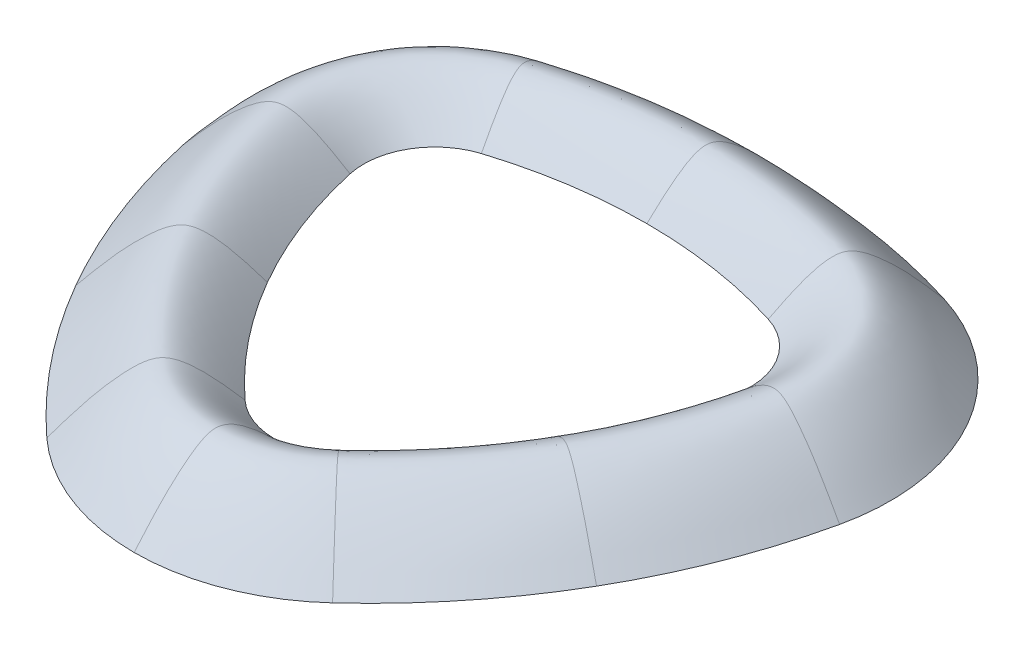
ISO-10303-21;
HEADER;
FILE_DESCRIPTION(('STEP AP214'),'2;1');
FILE_NAME('part.step','',(''),(''),'','','');
FILE_SCHEMA(('AUTOMOTIVE_DESIGN { 1 0 10303 214 1 1 1 1 }'));
ENDSEC;
DATA;
#1=APPLICATION_CONTEXT('core data for automotive mechanical design processes');
#2=APPLICATION_PROTOCOL_DEFINITION('international standard','automotive_design',2000,#1);
#3=PRODUCT_CONTEXT('',#1,'mechanical');
#4=PRODUCT('Part','Part','',(#3));
#5=PRODUCT_RELATED_PRODUCT_CATEGORY('part','',(#4));
#6=PRODUCT_DEFINITION_FORMATION('','',#4);
#7=PRODUCT_DEFINITION_CONTEXT('part definition',#1,'design');
#8=PRODUCT_DEFINITION('design','',#6,#7);
#9=PRODUCT_DEFINITION_SHAPE('','',#8);
#10=(LENGTH_UNIT() NAMED_UNIT(*) SI_UNIT(.MILLI.,.METRE.));
#11=(NAMED_UNIT(*) PLANE_ANGLE_UNIT() SI_UNIT($,.RADIAN.));
#12=(NAMED_UNIT(*) SI_UNIT($,.STERADIAN.) SOLID_ANGLE_UNIT());
#13=UNCERTAINTY_MEASURE_WITH_UNIT(LENGTH_MEASURE(1.E-05),#10,'distance_accuracy_value','');
#14=(GEOMETRIC_REPRESENTATION_CONTEXT(3) GLOBAL_UNCERTAINTY_ASSIGNED_CONTEXT((#13)) GLOBAL_UNIT_ASSIGNED_CONTEXT((#10,
#11,#12)) REPRESENTATION_CONTEXT('',''));
#15=CARTESIAN_POINT('',(0.,0.,0.));
#16=DIRECTION('',(0.,0.,1.));
#17=DIRECTION('',(1.,0.,0.));
#18=AXIS2_PLACEMENT_3D('',#15,#16,#17);
#19=DIRECTION('',(-0.675899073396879,0.00535319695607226,-0.73697475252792));
#20=VECTOR('',#19,1.);
#21=CARTESIAN_POINT('',(28.2532258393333,113.999999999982,33.5021687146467));
#22=LINE('',#21,#20);
#23=CARTESIAN_POINT('',(17.1026226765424,109.999999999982,21.340161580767));
#24=DIRECTION('',(0.,-1.,0.));
#25=AXIS1_PLACEMENT('',#23,#24);
#26=SURFACE_OF_REVOLUTION('',#22,#25);
#27=CARTESIAN_POINT('',(28.2532258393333,113.999999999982,33.5021687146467));
#28=VERTEX_POINT('',#27);
#29=CARTESIAN_POINT('',(23.923493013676,114.034291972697,28.781192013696));
#30=VERTEX_POINT('',#29);
#31=EDGE_CURVE('E197',#28,#30,#22,.T.);
#32=ORIENTED_EDGE('',*,*,#31,.F.);
#33=CARTESIAN_POINT('',(17.1026226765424,113.999999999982,21.340161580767));
#34=DIRECTION('',(0.,-1.,0.));
#35=DIRECTION('',(0.,0.,-1.));
#36=AXIS2_PLACEMENT_3D('',#33,#34,#35);
#37=CIRCLE('',#36,16.5000111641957);
#38=CARTESIAN_POINT('',(17.1000208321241,113.999999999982,37.8401725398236));
#39=VERTEX_POINT('',#38);
#40=EDGE_CURVE('E45',#28,#39,#37,.T.);
#41=ORIENTED_EDGE('',*,*,#40,.T.);
#42=CARTESIAN_POINT('',(17.1000208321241,113.999999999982,37.8401725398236));
#43=CARTESIAN_POINT('',(17.1000212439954,114.001428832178,37.573264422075));
#44=CARTESIAN_POINT('',(17.1000216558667,114.002857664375,37.3063563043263));
#45=CARTESIAN_POINT('',(17.1000224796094,114.005715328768,36.772540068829));
#46=CARTESIAN_POINT('',(17.1000228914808,114.007144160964,36.5056319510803));
#47=CARTESIAN_POINT('',(17.1000237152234,114.010001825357,35.971815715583));
#48=CARTESIAN_POINT('',(17.1000241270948,114.011430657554,35.7049075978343));
#49=CARTESIAN_POINT('',(17.1000249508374,114.014288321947,35.171091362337));
#50=CARTESIAN_POINT('',(17.1000253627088,114.015717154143,34.9041832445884));
#51=CARTESIAN_POINT('',(17.1000261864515,114.018574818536,34.3703670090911));
#52=CARTESIAN_POINT('',(17.1000265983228,114.020003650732,34.1034588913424));
#53=CARTESIAN_POINT('',(17.1000274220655,114.022861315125,33.5696426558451));
#54=CARTESIAN_POINT('',(17.1000278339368,114.024290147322,33.3027345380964));
#55=CARTESIAN_POINT('',(17.1000286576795,114.027147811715,32.7689183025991));
#56=CARTESIAN_POINT('',(17.1000290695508,114.028576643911,32.5020101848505));
#57=CARTESIAN_POINT('',(17.1000298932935,114.031434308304,31.9681939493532));
#58=CARTESIAN_POINT('',(17.1000303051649,114.0328631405,31.7012858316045));
#59=CARTESIAN_POINT('',(17.1000307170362,114.034291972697,31.4343777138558));
#60=B_SPLINE_CURVE_WITH_KNOTS('',3,(#42,#43,#44,#45,#46,#47,#48,#49,#50,#51,#52,#53,#54,#55,#56,
#57,#58,#59),.UNSPECIFIED.,.F.,.F.,(4,2,2,2,2,2,2,2,4),(0.,0.800735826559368,1.60147165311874,
2.4022074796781,3.20294330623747,4.00367913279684,4.80441495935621,5.60515078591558,
6.40588661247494),.UNSPECIFIED.);
#61=CARTESIAN_POINT('',(17.1000307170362,114.034291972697,31.4343777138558));
#62=VERTEX_POINT('',#61);
#63=EDGE_CURVE('E188',#39,#62,#60,.T.);
#64=ORIENTED_EDGE('',*,*,#63,.T.);
#65=CARTESIAN_POINT('',(17.1026226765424,114.034291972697,21.340161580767));
#66=DIRECTION('',(0.,-1.,0.));
#67=DIRECTION('',(0.,0.,-1.));
#68=AXIS2_PLACEMENT_3D('',#65,#66,#67);
#69=CIRCLE('',#68,10.0942164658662);
#70=EDGE_CURVE('E11',#30,#62,#69,.T.);
#71=ORIENTED_EDGE('',*,*,#70,.F.);
#72=EDGE_LOOP('',(#32,#41,#64,#71));
#73=FACE_BOUND('',#72,.T.);
#74=ADVANCED_FACE('F35',(#73),#26,.T.);
#75=CARTESIAN_POINT('',(23.923493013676,114.034291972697,28.781192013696));
#76=CARTESIAN_POINT('',(26.1064058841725,117.097954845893,31.1613575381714));
#77=CARTESIAN_POINT('',(28.0348659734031,119.363847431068,33.2640773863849));
#78=CARTESIAN_POINT('',(30.3911515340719,119.628897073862,35.8332819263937));
#79=CARTESIAN_POINT('',(33.8820799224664,116.139888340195,39.6396580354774));
#80=CARTESIAN_POINT('',(36.0071001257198,112.293182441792,41.9566995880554));
#81=CARTESIAN_POINT('',(37.3779940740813,109.999999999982,43.4514704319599));
#82=B_SPLINE_CURVE_WITH_KNOTS('',3,(#75,#76,#77,#78,#79,#80,#81),.UNSPECIFIED.,.F.,.F.,(4,1,1,1,
4),(0.,0.293862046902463,0.347704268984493,0.538422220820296,1.),.UNSPECIFIED.);
#83=CARTESIAN_POINT('',(17.1026226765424,109.999999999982,21.340161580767));
#84=DIRECTION('',(0.,-1.,0.));
#85=AXIS1_PLACEMENT('',#83,#84);
#86=SURFACE_OF_REVOLUTION('',#82,#85);
#87=CARTESIAN_POINT('',(37.3779940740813,109.999999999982,43.4514704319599));
#88=VERTEX_POINT('',#87);
#89=EDGE_CURVE('E479',#30,#88,#82,.T.);
#90=ORIENTED_EDGE('',*,*,#89,.F.);
#91=ORIENTED_EDGE('',*,*,#70,.T.);
#92=CARTESIAN_POINT('',(17.1000307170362,114.034291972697,31.4343777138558));
#93=CARTESIAN_POINT('',(17.1000302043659,114.349166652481,31.766607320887));
#94=CARTESIAN_POINT('',(17.1000296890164,114.662297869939,32.1005732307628));
#95=CARTESIAN_POINT('',(17.1000286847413,115.261245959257,32.7513812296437));
#96=CARTESIAN_POINT('',(17.1000281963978,115.547473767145,33.0678462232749));
#97=CARTESIAN_POINT('',(17.1000272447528,116.091875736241,33.6845479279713));
#98=CARTESIAN_POINT('',(17.1000267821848,116.350584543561,33.9843093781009));
#99=CARTESIAN_POINT('',(17.1000258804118,116.838901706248,34.5686922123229));
#100=CARTESIAN_POINT('',(17.100025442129,117.069221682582,34.8527159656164));
#101=CARTESIAN_POINT('',(17.1000245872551,117.499792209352,35.4067064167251));
#102=CARTESIAN_POINT('',(17.1000241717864,117.700966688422,35.675945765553));
#103=CARTESIAN_POINT('',(17.1000235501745,117.985441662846,36.0787736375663));
#104=CARTESIAN_POINT('',(17.1000233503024,118.074495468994,36.2082982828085));
#105=CARTESIAN_POINT('',(17.1000229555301,118.244796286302,36.4641255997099));
#106=CARTESIAN_POINT('',(17.1000227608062,118.326214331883,36.590313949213));
#107=CARTESIAN_POINT('',(17.1000223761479,118.481123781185,36.8395869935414));
#108=CARTESIAN_POINT('',(17.1000221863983,118.554807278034,36.9625518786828));
#109=CARTESIAN_POINT('',(17.100021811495,118.694120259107,37.2055033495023));
#110=CARTESIAN_POINT('',(17.1000216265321,118.759964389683,37.3253662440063));
#111=CARTESIAN_POINT('',(17.1000212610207,118.883469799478,37.5622313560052));
#112=CARTESIAN_POINT('',(17.1000210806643,118.941368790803,37.6791090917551));
#113=CARTESIAN_POINT('',(17.1000207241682,119.048861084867,37.9101319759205));
#114=CARTESIAN_POINT('',(17.1000205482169,119.098714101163,38.0241550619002));
#115=CARTESIAN_POINT('',(17.1000202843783,119.167938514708,38.1951323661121));
#116=CARTESIAN_POINT('',(17.100020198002,119.189741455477,38.251107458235));
#117=CARTESIAN_POINT('',(17.1000200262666,119.231257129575,38.3623984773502));
#118=CARTESIAN_POINT('',(17.1000199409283,119.251005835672,38.4177009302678));
#119=CARTESIAN_POINT('',(17.1000197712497,119.28839884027,38.5276590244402));
#120=CARTESIAN_POINT('',(17.1000196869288,119.306079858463,38.5823021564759));
#121=CARTESIAN_POINT('',(17.1000195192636,119.339324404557,38.6909554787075));
#122=CARTESIAN_POINT('',(17.100019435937,119.354925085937,38.7449542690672));
#123=CARTESIAN_POINT('',(17.1000192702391,119.383993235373,38.8523327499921));
#124=CARTESIAN_POINT('',(17.1000191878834,119.397497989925,38.905702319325));
#125=CARTESIAN_POINT('',(17.1000190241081,119.422369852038,39.0118348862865));
#126=CARTESIAN_POINT('',(17.1000189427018,119.433773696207,39.0645892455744));
#127=CARTESIAN_POINT('',(17.1000187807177,119.454404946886,39.1695610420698));
#128=CARTESIAN_POINT('',(17.1000187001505,119.463667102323,39.2217716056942));
#129=CARTESIAN_POINT('',(17.1000185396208,119.479920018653,39.3258008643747));
#130=CARTESIAN_POINT('',(17.1000184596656,119.486940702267,39.3776148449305));
#131=CARTESIAN_POINT('',(17.1000183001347,119.498632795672,39.4809968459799));
#132=CARTESIAN_POINT('',(17.100018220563,119.503326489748,39.5325623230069));
#133=CARTESIAN_POINT('',(17.1000180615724,119.510286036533,39.6355941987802));
#134=CARTESIAN_POINT('',(17.1000179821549,119.512564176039,39.6870597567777));
#135=CARTESIAN_POINT('',(17.1000178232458,119.514615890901,39.7900387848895));
#136=CARTESIAN_POINT('',(17.1000177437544,119.514389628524,39.8415522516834));
#137=CARTESIAN_POINT('',(17.1000175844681,119.511362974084,39.9447757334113));
#138=CARTESIAN_POINT('',(17.1000175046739,119.508549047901,39.996485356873));
#139=CARTESIAN_POINT('',(17.1000173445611,119.500258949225,40.100244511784));
#140=CARTESIAN_POINT('',(17.1000172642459,119.494754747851,40.1522917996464));
#141=CARTESIAN_POINT('',(17.1000171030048,119.481107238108,40.2567820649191));
#142=CARTESIAN_POINT('',(17.1000170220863,119.472927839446,40.3092202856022));
#143=CARTESIAN_POINT('',(17.1000168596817,119.454052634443,40.4144645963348));
#144=CARTESIAN_POINT('',(17.1000167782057,119.443320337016,40.4672640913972));
#145=CARTESIAN_POINT('',(17.1000166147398,119.419438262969,40.5731961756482));
#146=CARTESIAN_POINT('',(17.1000165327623,119.406252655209,40.6263206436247));
#147=CARTESIAN_POINT('',(17.1000163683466,119.377567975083,40.7328681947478));
#148=CARTESIAN_POINT('',(17.1000162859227,119.362034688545,40.7862820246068));
#149=CARTESIAN_POINT('',(17.1000161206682,119.328756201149,40.8933730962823));
#150=CARTESIAN_POINT('',(17.1000160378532,119.310978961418,40.9470403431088));
#151=CARTESIAN_POINT('',(17.1000158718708,119.273314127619,41.0546032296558));
#152=CARTESIAN_POINT('',(17.1000157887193,119.253397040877,41.1084885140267));
#153=CARTESIAN_POINT('',(17.1000156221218,119.211553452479,41.2164499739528));
#154=CARTESIAN_POINT('',(17.1000155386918,119.189600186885,41.2705157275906));
#155=CARTESIAN_POINT('',(17.1000152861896,119.120374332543,41.4341466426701));
#156=CARTESIAN_POINT('',(17.1000151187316,119.070617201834,41.5426657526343));
#157=CARTESIAN_POINT('',(17.1000147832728,118.964380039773,41.7600556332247));
#158=CARTESIAN_POINT('',(17.1000146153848,118.907752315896,41.8688533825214));
#159=CARTESIAN_POINT('',(17.100014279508,118.788555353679,42.0865141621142));
#160=CARTESIAN_POINT('',(17.1000141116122,118.725876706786,42.1953169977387));
#161=CARTESIAN_POINT('',(17.1000137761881,118.595373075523,42.412684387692));
#162=CARTESIAN_POINT('',(17.1000136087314,118.527471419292,42.5212026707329));
#163=CARTESIAN_POINT('',(17.1000132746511,118.387319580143,42.7376992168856));
#164=CARTESIAN_POINT('',(17.1000131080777,118.315019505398,42.8456450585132));
#165=CARTESIAN_POINT('',(17.1000127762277,118.166879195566,43.0606963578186));
#166=CARTESIAN_POINT('',(17.1000126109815,118.091010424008,43.1677820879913));
#167=CARTESIAN_POINT('',(17.1000121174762,117.859091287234,43.4875921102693));
#168=CARTESIAN_POINT('',(17.1000117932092,117.699480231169,43.6977292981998));
#169=CARTESIAN_POINT('',(17.1000111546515,117.37583340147,44.1115387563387));
#170=CARTESIAN_POINT('',(17.100010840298,117.211848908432,44.3152516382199));
#171=CARTESIAN_POINT('',(17.1000099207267,116.719748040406,44.9111683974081));
#172=CARTESIAN_POINT('',(17.1000093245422,116.384496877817,45.2975183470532));
#173=CARTESIAN_POINT('',(17.1000081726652,115.707116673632,46.0439779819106));
#174=CARTESIAN_POINT('',(17.1000076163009,115.365464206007,46.4045229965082));
#175=CARTESIAN_POINT('',(17.1000065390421,114.679133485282,47.1026272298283));
#176=CARTESIAN_POINT('',(17.100006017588,114.334822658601,47.4405490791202));
#177=CARTESIAN_POINT('',(17.1000050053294,113.646925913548,48.0965307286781));
#178=CARTESIAN_POINT('',(17.1000045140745,113.303616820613,48.4148823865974));
#179=CARTESIAN_POINT('',(17.1000035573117,112.621492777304,49.0349006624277));
#180=CARTESIAN_POINT('',(17.1000030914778,112.282868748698,49.3367785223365));
#181=CARTESIAN_POINT('',(17.1000021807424,111.61382177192,49.9269693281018));
#182=CARTESIAN_POINT('',(17.1000017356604,111.283501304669,50.2153991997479));
#183=CARTESIAN_POINT('',(17.100000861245,110.634965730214,50.7820532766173));
#184=CARTESIAN_POINT('',(17.100000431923,110.316744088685,51.0602700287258));
#185=CARTESIAN_POINT('',(17.0999999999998,109.999999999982,51.3401725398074));
#186=B_SPLINE_CURVE_WITH_KNOTS('',3,(#92,#93,#94,#95,#96,#97,#98,#99,#100,#101,#102,#103,#104,
#105,#106,#107,#108,#109,#110,#111,#112,#113,#114,#115,#116,#117,#118,#119,#120,#121,#122,#123,
#124,#125,#126,#127,#128,#129,#130,#131,#132,#133,#134,#135,#136,#137,#138,#139,#140,#141,#142,
#143,#144,#145,#146,#147,#148,#149,#150,#151,#152,#153,#154,#155,#156,#157,#158,#159,#160,#161,
#162,#163,#164,#165,#166,#167,#168,#169,#170,#171,#172,#173,#174,#175,#176,#177,#178,#179,#180,
#181,#182,#183,#184,#185),.UNSPECIFIED.,.F.,.F.,(4,2,2,2,2,2,2,2,2,2,2,2,2,2,2,2,2,2,2,2,2,2,2,
2,2,2,2,2,2,2,2,2,2,2,2,2,2,2,2,2,2,2,2,2,2,2,4),(0.,1.37329305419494,2.65333547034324,
3.84107789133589,4.93789747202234,5.94578923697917,6.41728938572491,6.86773931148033,
7.29770535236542,7.70786722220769,8.09903948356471,8.47219598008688,8.6523900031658,
8.82853277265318,9.00080309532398,9.16939488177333,9.33451790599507,9.49640177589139,
9.65543867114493,9.81225390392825,9.96753690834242,10.1220262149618,10.276505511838,
10.43179739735,10.5887428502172,10.7478995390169,10.9094846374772,11.073647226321,
11.2404863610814,11.4100559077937,11.5823692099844,11.7574034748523,12.1153539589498,
12.4831877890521,12.8597847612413,13.2437465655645,13.6334581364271,14.0271351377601,
14.8185820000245,15.6030660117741,17.1370121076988,18.6267559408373,20.073798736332,
21.4782592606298,22.8391547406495,24.1547248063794,25.422803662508),.UNSPECIFIED.);
#187=CARTESIAN_POINT('',(17.0999999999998,109.999999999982,51.3401725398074));
#188=VERTEX_POINT('',#187);
#189=EDGE_CURVE('E53',#62,#188,#186,.T.);
#190=ORIENTED_EDGE('',*,*,#189,.T.);
#191=CARTESIAN_POINT('',(17.1026226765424,109.999999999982,21.340161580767));
#192=DIRECTION('',(0.,-1.,0.));
#193=DIRECTION('',(0.,0.,-1.));
#194=AXIS2_PLACEMENT_3D('',#191,#192,#193);
#195=CIRCLE('',#194,30.0000110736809);
#196=EDGE_CURVE('E193',#88,#188,#195,.T.);
#197=ORIENTED_EDGE('',*,*,#196,.F.);
#198=EDGE_LOOP('',(#90,#91,#190,#197));
#199=FACE_BOUND('',#198,.T.);
#200=ADVANCED_FACE('F473',(#199),#86,.T.);
#201=DIRECTION('',(-0.866055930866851,0.00535319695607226,-0.499918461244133));
#202=VECTOR('',#201,1.);
#203=CARTESIAN_POINT('',(42.357762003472,113.999999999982,15.9225766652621));
#204=LINE('',#203,#202);
#205=CARTESIAN_POINT('',(-21.8685633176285,109.999999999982,-21.1597701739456));
#206=DIRECTION('',(0.,-1.,0.));
#207=AXIS1_PLACEMENT('',#205,#206);
#208=SURFACE_OF_REVOLUTION('',#204,#207);
#209=CARTESIAN_POINT('',(42.357762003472,113.999999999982,15.9225766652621));
#210=VERTEX_POINT('',#209);
#211=CARTESIAN_POINT('',(36.8099059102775,114.034291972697,12.7201556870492));
#212=VERTEX_POINT('',#211);
#213=EDGE_CURVE('E465',#210,#212,#204,.T.);
#214=ORIENTED_EDGE('',*,*,#213,.F.);
#215=CARTESIAN_POINT('',(-21.8685633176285,113.999999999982,-21.1597701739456));
#216=DIRECTION('',(0.,-1.,0.));
#217=DIRECTION('',(0.,0.,-1.));
#218=AXIS2_PLACEMENT_3D('',#215,#216,#217);
#219=CIRCLE('',#218,74.1628027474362);
#220=EDGE_CURVE('E500',#210,#28,#219,.T.);
#221=ORIENTED_EDGE('',*,*,#220,.T.);
#222=ORIENTED_EDGE('',*,*,#31,.T.);
#223=CARTESIAN_POINT('',(-21.8685633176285,114.034291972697,-21.1597701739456));
#224=DIRECTION('',(0.,-1.,0.));
#225=DIRECTION('',(0.,0.,-1.));
#226=AXIS2_PLACEMENT_3D('',#223,#224,#225);
#227=CIRCLE('',#226,67.7570079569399);
#228=EDGE_CURVE('E503',#212,#30,#227,.T.);
#229=ORIENTED_EDGE('',*,*,#228,.F.);
#230=EDGE_LOOP('',(#214,#221,#222,#229));
#231=FACE_BOUND('',#230,.T.);
#232=ADVANCED_FACE('F471',(#231),#208,.T.);
#233=CARTESIAN_POINT('',(-21.8685633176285,109.999999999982,-21.1597701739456));
#234=DIRECTION('',(0.,-1.,0.));
#235=DIRECTION('',(0.,0.,-1.));
#236=AXIS2_PLACEMENT_3D('',#233,#234,#235);
#237=CYLINDRICAL_SURFACE('',#236,74.1628027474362);
#238=DIRECTION('',(0.,1.,0.));
#239=VECTOR('',#238,1.);
#240=CARTESIAN_POINT('',(42.357762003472,113.999999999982,15.9225766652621));
#241=LINE('',#240,#239);
#242=CARTESIAN_POINT('',(42.357762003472,109.999999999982,15.9225766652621));
#243=VERTEX_POINT('',#242);
#244=EDGE_CURVE('E457',#243,#210,#241,.T.);
#245=ORIENTED_EDGE('',*,*,#244,.F.);
#246=CARTESIAN_POINT('',(-21.8685633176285,109.999999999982,-21.1597701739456));
#247=DIRECTION('',(0.,-1.,0.));
#248=DIRECTION('',(0.,0.,-1.));
#249=AXIS2_PLACEMENT_3D('',#246,#247,#248);
#250=CIRCLE('',#249,74.1628027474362);
#251=CARTESIAN_POINT('',(28.2532258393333,109.999999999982,33.5021687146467));
#252=VERTEX_POINT('',#251);
#253=EDGE_CURVE('E497',#243,#252,#250,.T.);
#254=ORIENTED_EDGE('',*,*,#253,.T.);
#255=DIRECTION('',(0.,1.,0.));
#256=VECTOR('',#255,1.);
#257=CARTESIAN_POINT('',(28.2532258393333,113.999999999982,33.5021687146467));
#258=LINE('',#257,#256);
#259=EDGE_CURVE('E486',#252,#28,#258,.T.);
#260=ORIENTED_EDGE('',*,*,#259,.T.);
#261=ORIENTED_EDGE('',*,*,#220,.F.);
#262=EDGE_LOOP('',(#245,#254,#260,#261));
#263=FACE_BOUND('',#262,.T.);
#264=ADVANCED_FACE('F447',(#263),#237,.F.);
#265=CARTESIAN_POINT('',(36.8099059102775,114.034291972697,12.7201556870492));
#266=CARTESIAN_POINT('',(39.6069575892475,117.097954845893,14.3347139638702));
#267=CARTESIAN_POINT('',(42.0779689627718,119.363847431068,15.7610701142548));
#268=CARTESIAN_POINT('',(45.0971698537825,119.628897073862,17.5038608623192));
#269=CARTESIAN_POINT('',(49.5702329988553,116.139888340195,20.0858729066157));
#270=CARTESIAN_POINT('',(52.2931045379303,112.293182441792,21.6576117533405));
#271=CARTESIAN_POINT('',(54.0496845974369,109.999999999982,22.671572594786));
#272=B_SPLINE_CURVE_WITH_KNOTS('',3,(#265,#266,#267,#268,#269,#270,#271),.UNSPECIFIED.,.F.,.F.,
(4,1,1,1,4),(0.,0.293862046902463,0.347704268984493,0.538422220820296,1.),.UNSPECIFIED.);
#273=CARTESIAN_POINT('',(-21.8685633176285,109.999999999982,-21.1597701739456));
#274=DIRECTION('',(0.,-1.,0.));
#275=AXIS1_PLACEMENT('',#273,#274);
#276=SURFACE_OF_REVOLUTION('',#272,#275);
#277=CARTESIAN_POINT('',(54.0496845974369,109.999999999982,22.671572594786));
#278=VERTEX_POINT('',#277);
#279=EDGE_CURVE('E450',#212,#278,#272,.T.);
#280=ORIENTED_EDGE('',*,*,#279,.F.);
#281=ORIENTED_EDGE('',*,*,#228,.T.);
#282=ORIENTED_EDGE('',*,*,#89,.T.);
#283=CARTESIAN_POINT('',(-21.8685633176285,109.999999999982,-21.1597701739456));
#284=DIRECTION('',(0.,-1.,0.));
#285=DIRECTION('',(0.,0.,-1.));
#286=AXIS2_PLACEMENT_3D('',#283,#284,#285);
#287=CIRCLE('',#286,87.6628026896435);
#288=EDGE_CURVE('E494',#278,#88,#287,.T.);
#289=ORIENTED_EDGE('',*,*,#288,.F.);
#290=EDGE_LOOP('',(#280,#281,#282,#289));
#291=FACE_BOUND('',#290,.T.);
#292=ADVANCED_FACE('F442',(#291),#276,.T.);
#293=DIRECTION('',(-0.976225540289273,0.00535319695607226,-0.216691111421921));
#294=VECTOR('',#293,1.);
#295=CARTESIAN_POINT('',(50.5305174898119,113.999999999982,-5.08182140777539));
#296=LINE('',#295,#294);
#297=CARTESIAN_POINT('',(-21.8684956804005,109.999999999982,-21.1598873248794));
#298=DIRECTION('',(0.,-1.,0.));
#299=AXIS1_PLACEMENT('',#297,#298);
#300=SURFACE_OF_REVOLUTION('',#296,#299);
#301=CARTESIAN_POINT('',(50.5305174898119,113.999999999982,-5.08182140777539));
#302=VERTEX_POINT('',#301);
#303=CARTESIAN_POINT('',(44.2769273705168,114.034291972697,-6.46992009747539));
#304=VERTEX_POINT('',#303);
#305=EDGE_CURVE('E433',#302,#304,#296,.T.);
#306=ORIENTED_EDGE('',*,*,#305,.F.);
#307=CARTESIAN_POINT('',(-21.8684956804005,113.999999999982,-21.1598873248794));
#308=DIRECTION('',(0.,-1.,0.));
#309=DIRECTION('',(0.,0.,-1.));
#310=AXIS2_PLACEMENT_3D('',#307,#308,#309);
#311=CIRCLE('',#310,74.1628027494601);
#312=EDGE_CURVE('E542',#302,#210,#311,.T.);
#313=ORIENTED_EDGE('',*,*,#312,.T.);
#314=ORIENTED_EDGE('',*,*,#213,.T.);
#315=CARTESIAN_POINT('',(-21.8684956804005,114.034291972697,-21.1598873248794));
#316=DIRECTION('',(0.,-1.,0.));
#317=DIRECTION('',(0.,0.,-1.));
#318=AXIS2_PLACEMENT_3D('',#315,#316,#317);
#319=CIRCLE('',#318,67.7570079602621);
#320=EDGE_CURVE('E487',#304,#212,#319,.T.);
#321=ORIENTED_EDGE('',*,*,#320,.F.);
#322=EDGE_LOOP('',(#306,#313,#314,#321));
#323=FACE_BOUND('',#322,.T.);
#324=ADVANCED_FACE('F439',(#323),#300,.T.);
#325=CARTESIAN_POINT('',(-21.8684956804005,109.999999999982,-21.1598873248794));
#326=DIRECTION('',(0.,-1.,0.));
#327=DIRECTION('',(0.,0.,-1.));
#328=AXIS2_PLACEMENT_3D('',#325,#326,#327);
#329=CYLINDRICAL_SURFACE('',#328,74.1628027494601);
#330=DIRECTION('',(0.,1.,0.));
#331=VECTOR('',#330,1.);
#332=CARTESIAN_POINT('',(50.5305174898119,113.999999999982,-5.08182140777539));
#333=LINE('',#332,#331);
#334=CARTESIAN_POINT('',(50.5305174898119,109.999999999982,-5.08182140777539));
#335=VERTEX_POINT('',#334);
#336=EDGE_CURVE('E425',#335,#302,#333,.T.);
#337=ORIENTED_EDGE('',*,*,#336,.F.);
#338=CARTESIAN_POINT('',(-21.8684956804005,109.999999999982,-21.1598873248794));
#339=DIRECTION('',(0.,-1.,0.));
#340=DIRECTION('',(0.,0.,-1.));
#341=AXIS2_PLACEMENT_3D('',#338,#339,#340);
#342=CIRCLE('',#341,74.1628027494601);
#343=EDGE_CURVE('E544',#335,#243,#342,.T.);
#344=ORIENTED_EDGE('',*,*,#343,.T.);
#345=ORIENTED_EDGE('',*,*,#244,.T.);
#346=ORIENTED_EDGE('',*,*,#312,.F.);
#347=EDGE_LOOP('',(#337,#344,#345,#346));
#348=FACE_BOUND('',#347,.T.);
#349=ADVANCED_FACE('F415',(#348),#329,.F.);
#350=CARTESIAN_POINT('',(44.2769273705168,114.034291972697,-6.46992009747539));
#351=CARTESIAN_POINT('',(47.4297875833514,117.097954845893,-5.77008511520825));
#352=CARTESIAN_POINT('',(50.2151324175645,119.363847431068,-5.15182689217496));
#353=CARTESIAN_POINT('',(53.6184010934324,119.628897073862,-4.39640917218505));
#354=CARTESIAN_POINT('',(58.6604755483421,116.139888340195,-3.27722853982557));
#355=CARTESIAN_POINT('',(61.7297192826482,112.293182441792,-2.59595376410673));
#356=CARTESIAN_POINT('',(63.7097511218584,109.999999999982,-2.15644948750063));
#357=B_SPLINE_CURVE_WITH_KNOTS('',3,(#350,#351,#352,#353,#354,#355,#356),.UNSPECIFIED.,.F.,.F.,
(4,1,1,1,4),(0.,0.293862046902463,0.347704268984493,0.538422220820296,1.),.UNSPECIFIED.);
#358=CARTESIAN_POINT('',(-21.8684956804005,109.999999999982,-21.1598873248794));
#359=DIRECTION('',(0.,-1.,0.));
#360=AXIS1_PLACEMENT('',#358,#359);
#361=SURFACE_OF_REVOLUTION('',#357,#360);
#362=CARTESIAN_POINT('',(63.7097511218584,109.999999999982,-2.15644948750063));
#363=VERTEX_POINT('',#362);
#364=EDGE_CURVE('E418',#304,#363,#357,.T.);
#365=ORIENTED_EDGE('',*,*,#364,.F.);
#366=ORIENTED_EDGE('',*,*,#320,.T.);
#367=ORIENTED_EDGE('',*,*,#279,.T.);
#368=CARTESIAN_POINT('',(-21.8684956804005,109.999999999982,-21.1598873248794));
#369=DIRECTION('',(0.,-1.,0.));
#370=DIRECTION('',(0.,0.,-1.));
#371=AXIS2_PLACEMENT_3D('',#368,#369,#370);
#372=CIRCLE('',#371,87.6628026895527);
#373=EDGE_CURVE('E469',#363,#278,#372,.T.);
#374=ORIENTED_EDGE('',*,*,#373,.F.);
#375=EDGE_LOOP('',(#365,#366,#367,#374));
#376=FACE_BOUND('',#375,.T.);
#377=ADVANCED_FACE('F410',(#376),#361,.T.);
#378=DIRECTION('',(-0.300287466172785,0.00535319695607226,0.95383372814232));
#379=VECTOR('',#378,1.);
#380=CARTESIAN_POINT('',(39.3804149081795,113.999999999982,-24.3975279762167));
#381=LINE('',#380,#379);
#382=CARTESIAN_POINT('',(34.423117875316,109.999999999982,-8.65981611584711));
#383=DIRECTION('',(0.,-1.,0.));
#384=AXIS1_PLACEMENT('',#382,#383);
#385=SURFACE_OF_REVOLUTION('',#381,#384);
#386=CARTESIAN_POINT('',(39.3804149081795,113.999999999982,-24.3975279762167));
#387=VERTEX_POINT('',#386);
#388=CARTESIAN_POINT('',(37.4568074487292,114.034291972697,-18.2873772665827));
#389=VERTEX_POINT('',#388);
#390=EDGE_CURVE('E401',#387,#389,#381,.T.);
#391=ORIENTED_EDGE('',*,*,#390,.F.);
#392=CARTESIAN_POINT('',(34.423117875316,113.999999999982,-8.65981611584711));
#393=DIRECTION('',(0.,-1.,0.));
#394=DIRECTION('',(0.,0.,-1.));
#395=AXIS2_PLACEMENT_3D('',#392,#393,#394);
#396=CIRCLE('',#395,16.500011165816);
#397=EDGE_CURVE('E554',#387,#302,#396,.T.);
#398=ORIENTED_EDGE('',*,*,#397,.T.);
#399=ORIENTED_EDGE('',*,*,#305,.T.);
#400=CARTESIAN_POINT('',(34.423117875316,114.034291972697,-8.65981611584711));
#401=DIRECTION('',(0.,-1.,0.));
#402=DIRECTION('',(0.,0.,-1.));
#403=AXIS2_PLACEMENT_3D('',#400,#401,#402);
#404=CIRCLE('',#403,10.0942164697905);
#405=EDGE_CURVE('E458',#389,#304,#404,.T.);
#406=ORIENTED_EDGE('',*,*,#405,.F.);
#407=EDGE_LOOP('',(#391,#398,#399,#406));
#408=FACE_BOUND('',#407,.T.);
#409=ADVANCED_FACE('F407',(#408),#385,.T.);
#410=CARTESIAN_POINT('',(34.423117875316,109.999999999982,-8.65981611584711));
#411=DIRECTION('',(0.,-1.,0.));
#412=DIRECTION('',(0.,0.,-1.));
#413=AXIS2_PLACEMENT_3D('',#410,#411,#412);
#414=CYLINDRICAL_SURFACE('',#413,16.500011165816);
#415=DIRECTION('',(0.,1.,0.));
#416=VECTOR('',#415,1.);
#417=CARTESIAN_POINT('',(39.3804149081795,113.999999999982,-24.3975279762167));
#418=LINE('',#417,#416);
#419=CARTESIAN_POINT('',(39.3804149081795,109.999999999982,-24.3975279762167));
#420=VERTEX_POINT('',#419);
#421=EDGE_CURVE('E393',#420,#387,#418,.T.);
#422=ORIENTED_EDGE('',*,*,#421,.F.);
#423=CARTESIAN_POINT('',(34.423117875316,109.999999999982,-8.65981611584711));
#424=DIRECTION('',(0.,-1.,0.));
#425=DIRECTION('',(0.,0.,-1.));
#426=AXIS2_PLACEMENT_3D('',#423,#424,#425);
#427=CIRCLE('',#426,16.500011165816);
#428=EDGE_CURVE('E548',#420,#335,#427,.T.);
#429=ORIENTED_EDGE('',*,*,#428,.T.);
#430=ORIENTED_EDGE('',*,*,#336,.T.);
#431=ORIENTED_EDGE('',*,*,#397,.F.);
#432=EDGE_LOOP('',(#422,#429,#430,#431));
#433=FACE_BOUND('',#432,.T.);
#434=ADVANCED_FACE('F383',(#433),#414,.F.);
#435=CARTESIAN_POINT('',(37.4568074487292,114.034291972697,-18.2873772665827));
#436=CARTESIAN_POINT('',(38.4266288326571,117.097954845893,-21.367919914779));
#437=CARTESIAN_POINT('',(39.2834023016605,119.363847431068,-24.0893769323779));
#438=CARTESIAN_POINT('',(40.3302494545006,119.628897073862,-27.4145843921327));
#439=CARTESIAN_POINT('',(41.881194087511,116.139888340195,-32.341008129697));
#440=CARTESIAN_POINT('',(42.8252950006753,112.293182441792,-35.3398522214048));
#441=CARTESIAN_POINT('',(43.4343537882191,109.999999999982,-37.2744678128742));
#442=B_SPLINE_CURVE_WITH_KNOTS('',3,(#435,#436,#437,#438,#439,#440,#441),.UNSPECIFIED.,.F.,.F.,
(4,1,1,1,4),(0.,0.293862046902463,0.347704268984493,0.538422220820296,1.),.UNSPECIFIED.);
#443=CARTESIAN_POINT('',(34.423117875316,109.999999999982,-8.65981611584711));
#444=DIRECTION('',(0.,-1.,0.));
#445=AXIS1_PLACEMENT('',#443,#444);
#446=SURFACE_OF_REVOLUTION('',#442,#445);
#447=CARTESIAN_POINT('',(43.4343537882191,109.999999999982,-37.2744678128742));
#448=VERTEX_POINT('',#447);
#449=EDGE_CURVE('E386',#389,#448,#442,.T.);
#450=ORIENTED_EDGE('',*,*,#449,.F.);
#451=ORIENTED_EDGE('',*,*,#405,.T.);
#452=ORIENTED_EDGE('',*,*,#364,.T.);
#453=CARTESIAN_POINT('',(34.423117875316,109.999999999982,-8.65981611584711));
#454=DIRECTION('',(0.,-1.,0.));
#455=DIRECTION('',(0.,0.,-1.));
#456=AXIS2_PLACEMENT_3D('',#453,#454,#455);
#457=CIRCLE('',#456,30.0000110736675);
#458=EDGE_CURVE('E437',#448,#363,#457,.T.);
#459=ORIENTED_EDGE('',*,*,#458,.F.);
#460=EDGE_LOOP('',(#450,#451,#452,#459));
#461=FACE_BOUND('',#460,.T.);
#462=ADVANCED_FACE('F378',(#461),#446,.T.);
#463=DIRECTION('',(8.74212575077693E-05,0.00535319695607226,0.999985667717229));
#464=VECTOR('',#463,1.);
#465=CARTESIAN_POINT('',(17.1038028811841,113.999999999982,-27.8226158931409));
#466=LINE('',#465,#464);
#467=CARTESIAN_POINT('',(17.1026903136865,109.999999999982,46.3401868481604));
#468=DIRECTION('',(0.,-1.,0.));
#469=AXIS1_PLACEMENT('',#467,#468);
#470=SURFACE_OF_REVOLUTION('',#466,#469);
#471=CARTESIAN_POINT('',(17.1038028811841,113.999999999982,-27.8226158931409));
#472=VERTEX_POINT('',#471);
#473=CARTESIAN_POINT('',(17.1043628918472,114.034291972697,-21.4168210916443));
#474=VERTEX_POINT('',#473);
#475=EDGE_CURVE('E369',#472,#474,#466,.T.);
#476=ORIENTED_EDGE('',*,*,#475,.F.);
#477=CARTESIAN_POINT('',(17.1026903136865,113.999999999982,46.3401868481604));
#478=DIRECTION('',(0.,-1.,0.));
#479=DIRECTION('',(0.,0.,-1.));
#480=AXIS2_PLACEMENT_3D('',#477,#478,#479);
#481=CIRCLE('',#480,74.1628027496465);
#482=EDGE_CURVE('E560',#472,#387,#481,.T.);
#483=ORIENTED_EDGE('',*,*,#482,.T.);
#484=ORIENTED_EDGE('',*,*,#390,.T.);
#485=CARTESIAN_POINT('',(17.1026903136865,114.034291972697,46.3401868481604));
#486=DIRECTION('',(0.,-1.,0.));
#487=DIRECTION('',(0.,0.,-1.));
#488=AXIS2_PLACEMENT_3D('',#485,#486,#487);
#489=CIRCLE('',#488,67.7570079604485);
#490=EDGE_CURVE('E426',#474,#389,#489,.T.);
#491=ORIENTED_EDGE('',*,*,#490,.F.);
#492=EDGE_LOOP('',(#476,#483,#484,#491));
#493=FACE_BOUND('',#492,.T.);
#494=ADVANCED_FACE('F375',(#493),#470,.T.);
#495=CARTESIAN_POINT('',(17.1026903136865,109.999999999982,46.3401868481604));
#496=DIRECTION('',(0.,-1.,0.));
#497=DIRECTION('',(0.,0.,-1.));
#498=AXIS2_PLACEMENT_3D('',#495,#496,#497);
#499=CYLINDRICAL_SURFACE('',#498,74.1628027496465);
#500=DIRECTION('',(0.,1.,0.));
#501=VECTOR('',#500,1.);
#502=CARTESIAN_POINT('',(17.1038028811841,113.999999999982,-27.8226158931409));
#503=LINE('',#502,#501);
#504=CARTESIAN_POINT('',(17.1038028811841,109.999999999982,-27.8226158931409));
#505=VERTEX_POINT('',#504);
#506=EDGE_CURVE('E361',#505,#472,#503,.T.);
#507=ORIENTED_EDGE('',*,*,#506,.F.);
#508=CARTESIAN_POINT('',(17.1026903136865,109.999999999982,46.3401868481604));
#509=DIRECTION('',(0.,-1.,0.));
#510=DIRECTION('',(0.,0.,-1.));
#511=AXIS2_PLACEMENT_3D('',#508,#509,#510);
#512=CIRCLE('',#511,74.1628027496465);
#513=EDGE_CURVE('E551',#505,#420,#512,.T.);
#514=ORIENTED_EDGE('',*,*,#513,.T.);
#515=ORIENTED_EDGE('',*,*,#421,.T.);
#516=ORIENTED_EDGE('',*,*,#482,.F.);
#517=EDGE_LOOP('',(#507,#514,#515,#516));
#518=FACE_BOUND('',#517,.T.);
#519=ADVANCED_FACE('F351',(#518),#499,.F.);
#520=CARTESIAN_POINT('',(17.1043628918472,114.034291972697,-21.4168210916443));
#521=CARTESIAN_POINT('',(17.1040805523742,117.097954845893,-24.6464180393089));
#522=CARTESIAN_POINT('',(17.1038311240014,119.363847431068,-27.499554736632));
#523=CARTESIAN_POINT('',(17.1035263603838,119.628897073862,-30.9856547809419));
#524=CARTESIAN_POINT('',(17.1030748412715,116.139888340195,-36.1504471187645));
#525=CARTESIAN_POINT('',(17.1027999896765,112.293182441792,-39.2943924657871));
#526=CARTESIAN_POINT('',(17.1026226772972,109.999999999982,-41.3226158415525));
#527=B_SPLINE_CURVE_WITH_KNOTS('',3,(#520,#521,#522,#523,#524,#525,#526),.UNSPECIFIED.,.F.,.F.,
(4,1,1,1,4),(0.,0.293862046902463,0.347704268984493,0.538422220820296,1.),.UNSPECIFIED.);
#528=CARTESIAN_POINT('',(17.1026903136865,109.999999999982,46.3401868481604));
#529=DIRECTION('',(0.,-1.,0.));
#530=AXIS1_PLACEMENT('',#528,#529);
#531=SURFACE_OF_REVOLUTION('',#527,#530);
#532=CARTESIAN_POINT('',(17.1026226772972,109.999999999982,-41.3226158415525));
#533=VERTEX_POINT('',#532);
#534=EDGE_CURVE('E354',#474,#533,#527,.T.);
#535=ORIENTED_EDGE('',*,*,#534,.F.);
#536=ORIENTED_EDGE('',*,*,#490,.T.);
#537=ORIENTED_EDGE('',*,*,#449,.T.);
#538=CARTESIAN_POINT('',(17.1026903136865,109.999999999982,46.3401868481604));
#539=DIRECTION('',(0.,-1.,0.));
#540=DIRECTION('',(0.,0.,-1.));
#541=AXIS2_PLACEMENT_3D('',#538,#539,#540);
#542=CIRCLE('',#541,87.6628026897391);
#543=EDGE_CURVE('E405',#533,#448,#542,.T.);
#544=ORIENTED_EDGE('',*,*,#543,.F.);
#545=EDGE_LOOP('',(#535,#536,#537,#544));
#546=FACE_BOUND('',#545,.T.);
#547=ADVANCED_FACE('F346',(#546),#531,.T.);
#548=DIRECTION('',(0.300454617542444,0.00535319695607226,0.953781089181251));
#549=VECTOR('',#548,1.);
#550=CARTESIAN_POINT('',(-5.17294654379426,113.999999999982,-24.3982280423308));
#551=LINE('',#550,#549);
#552=CARTESIAN_POINT('',(17.1025550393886,109.999999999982,46.3401868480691));
#553=DIRECTION('',(0.,-1.,0.));
#554=AXIS1_PLACEMENT('',#552,#553);
#555=SURFACE_OF_REVOLUTION('',#551,#554);
#556=CARTESIAN_POINT('',(-5.17294654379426,113.999999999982,-24.3982280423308));
#557=VERTEX_POINT('',#556);
#558=CARTESIAN_POINT('',(-3.24826833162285,114.034291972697,-18.2884145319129));
#559=VERTEX_POINT('',#558);
#560=EDGE_CURVE('E337',#557,#559,#551,.T.);
#561=ORIENTED_EDGE('',*,*,#560,.F.);
#562=CARTESIAN_POINT('',(17.1025550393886,113.999999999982,46.3401868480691));
#563=DIRECTION('',(0.,-1.,0.));
#564=DIRECTION('',(0.,0.,-1.));
#565=AXIS2_PLACEMENT_3D('',#562,#563,#564);
#566=CIRCLE('',#565,74.1628027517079);
#567=EDGE_CURVE('E570',#557,#472,#566,.T.);
#568=ORIENTED_EDGE('',*,*,#567,.T.);
#569=ORIENTED_EDGE('',*,*,#475,.T.);
#570=CARTESIAN_POINT('',(17.1025550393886,114.034291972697,46.3401868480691));
#571=DIRECTION('',(0.,-1.,0.));
#572=DIRECTION('',(0.,0.,-1.));
#573=AXIS2_PLACEMENT_3D('',#570,#571,#572);
#574=CIRCLE('',#573,67.7570079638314);
#575=EDGE_CURVE('E394',#559,#474,#574,.T.);
#576=ORIENTED_EDGE('',*,*,#575,.F.);
#577=EDGE_LOOP('',(#561,#568,#569,#576));
#578=FACE_BOUND('',#577,.T.);
#579=ADVANCED_FACE('F343',(#578),#555,.T.);
#580=CARTESIAN_POINT('',(17.1025550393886,109.999999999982,46.3401868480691));
#581=DIRECTION('',(0.,-1.,0.));
#582=DIRECTION('',(0.,0.,-1.));
#583=AXIS2_PLACEMENT_3D('',#580,#581,#582);
#584=CYLINDRICAL_SURFACE('',#583,74.1628027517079);
#585=DIRECTION('',(0.,1.,0.));
#586=VECTOR('',#585,1.);
#587=CARTESIAN_POINT('',(-5.17294654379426,113.999999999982,-24.3982280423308));
#588=LINE('',#587,#586);
#589=CARTESIAN_POINT('',(-5.17294654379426,109.999999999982,-24.3982280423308));
#590=VERTEX_POINT('',#589);
#591=EDGE_CURVE('E329',#590,#557,#588,.T.);
#592=ORIENTED_EDGE('',*,*,#591,.F.);
#593=CARTESIAN_POINT('',(17.1025550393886,109.999999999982,46.3401868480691));
#594=DIRECTION('',(0.,-1.,0.));
#595=DIRECTION('',(0.,0.,-1.));
#596=AXIS2_PLACEMENT_3D('',#593,#594,#595);
#597=CIRCLE('',#596,74.1628027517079);
#598=EDGE_CURVE('E572',#590,#505,#597,.T.);
#599=ORIENTED_EDGE('',*,*,#598,.T.);
#600=ORIENTED_EDGE('',*,*,#506,.T.);
#601=ORIENTED_EDGE('',*,*,#567,.F.);
#602=EDGE_LOOP('',(#592,#599,#600,#601));
#603=FACE_BOUND('',#602,.T.);
#604=ADVANCED_FACE('F319',(#603),#584,.F.);
#605=CARTESIAN_POINT('',(-3.24826833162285,114.034291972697,-18.2884145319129));
#606=CARTESIAN_POINT('',(-4.21862955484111,117.097954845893,-21.3687871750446));
#607=CARTESIAN_POINT('',(-5.07587993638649,119.363847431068,-24.0900940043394));
#608=CARTESIAN_POINT('',(-6.12330980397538,119.628897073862,-27.4151179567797));
#609=CARTESIAN_POINT('',(-7.67511775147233,116.139888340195,-32.3412698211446));
#610=CARTESIAN_POINT('',(-8.61974418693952,112.293182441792,-35.3399484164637));
#611=CARTESIAN_POINT('',(-9.22914199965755,109.999999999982,-37.2744572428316));
#612=B_SPLINE_CURVE_WITH_KNOTS('',3,(#605,#606,#607,#608,#609,#610,#611),.UNSPECIFIED.,.F.,.F.,
(4,1,1,1,4),(0.,0.293862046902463,0.347704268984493,0.538422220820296,1.),.UNSPECIFIED.);
#613=CARTESIAN_POINT('',(17.1025550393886,109.999999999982,46.3401868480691));
#614=DIRECTION('',(0.,-1.,0.));
#615=AXIS1_PLACEMENT('',#613,#614);
#616=SURFACE_OF_REVOLUTION('',#612,#615);
#617=CARTESIAN_POINT('',(-9.22914199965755,109.999999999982,-37.2744572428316));
#618=VERTEX_POINT('',#617);
#619=EDGE_CURVE('E322',#559,#618,#612,.T.);
#620=ORIENTED_EDGE('',*,*,#619,.F.);
#621=ORIENTED_EDGE('',*,*,#575,.T.);
#622=ORIENTED_EDGE('',*,*,#534,.T.);
#623=CARTESIAN_POINT('',(17.1025550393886,109.999999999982,46.3401868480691));
#624=DIRECTION('',(0.,-1.,0.));
#625=DIRECTION('',(0.,0.,-1.));
#626=AXIS2_PLACEMENT_3D('',#623,#624,#625);
#627=CIRCLE('',#626,87.6628026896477);
#628=EDGE_CURVE('E373',#618,#533,#627,.T.);
#629=ORIENTED_EDGE('',*,*,#628,.F.);
#630=EDGE_LOOP('',(#620,#621,#622,#629));
#631=FACE_BOUND('',#630,.T.);
#632=ADVANCED_FACE('F314',(#631),#616,.T.);
#633=DIRECTION('',(0.976188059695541,0.00535319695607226,-0.216859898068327));
#634=VECTOR('',#633,1.);
#635=CARTESIAN_POINT('',(-16.3257857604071,113.999999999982,-5.08413441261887));
#636=LINE('',#635,#634);
#637=CARTESIAN_POINT('',(-0.217872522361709,109.999999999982,-8.65981611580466));
#638=DIRECTION('',(0.,-1.,0.));
#639=AXIS1_PLACEMENT('',#637,#638);
#640=SURFACE_OF_REVOLUTION('',#636,#639);
#641=CARTESIAN_POINT('',(-16.3257857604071,113.999999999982,-5.08413441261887));
#642=VERTEX_POINT('',#641);
#643=CARTESIAN_POINT('',(-10.0724357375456,114.034291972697,-6.47331433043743));
#644=VERTEX_POINT('',#643);
#645=EDGE_CURVE('E305',#642,#644,#636,.T.);
#646=ORIENTED_EDGE('',*,*,#645,.F.);
#647=CARTESIAN_POINT('',(-0.217872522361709,113.999999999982,-8.65981611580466));
#648=DIRECTION('',(0.,-1.,0.));
#649=DIRECTION('',(0.,0.,-1.));
#650=AXIS2_PLACEMENT_3D('',#647,#648,#649);
#651=CIRCLE('',#650,16.5000111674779);
#652=EDGE_CURVE('E582',#642,#557,#651,.T.);
#653=ORIENTED_EDGE('',*,*,#652,.T.);
#654=ORIENTED_EDGE('',*,*,#560,.T.);
#655=CARTESIAN_POINT('',(-0.217872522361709,114.034291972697,-8.65981611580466));
#656=DIRECTION('',(0.,-1.,0.));
#657=DIRECTION('',(0.,0.,-1.));
#658=AXIS2_PLACEMENT_3D('',#655,#656,#657);
#659=CIRCLE('',#658,10.0942164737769);
#660=EDGE_CURVE('E362',#644,#559,#659,.T.);
#661=ORIENTED_EDGE('',*,*,#660,.F.);
#662=EDGE_LOOP('',(#646,#653,#654,#661));
#663=FACE_BOUND('',#662,.T.);
#664=ADVANCED_FACE('F311',(#663),#640,.T.);
#665=CARTESIAN_POINT('',(-0.217872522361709,109.999999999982,-8.65981611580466));
#666=DIRECTION('',(0.,-1.,0.));
#667=DIRECTION('',(0.,0.,-1.));
#668=AXIS2_PLACEMENT_3D('',#665,#666,#667);
#669=CYLINDRICAL_SURFACE('',#668,16.5000111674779);
#670=DIRECTION('',(0.,1.,0.));
#671=VECTOR('',#670,1.);
#672=CARTESIAN_POINT('',(-16.3257857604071,113.999999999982,-5.08413441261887));
#673=LINE('',#672,#671);
#674=CARTESIAN_POINT('',(-16.3257857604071,109.999999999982,-5.08413441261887));
#675=VERTEX_POINT('',#674);
#676=EDGE_CURVE('E297',#675,#642,#673,.T.);
#677=ORIENTED_EDGE('',*,*,#676,.F.);
#678=CARTESIAN_POINT('',(-0.217872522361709,109.999999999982,-8.65981611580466));
#679=DIRECTION('',(0.,-1.,0.));
#680=DIRECTION('',(0.,0.,-1.));
#681=AXIS2_PLACEMENT_3D('',#678,#679,#680);
#682=CIRCLE('',#681,16.5000111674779);
#683=EDGE_CURVE('E576',#675,#590,#682,.T.);
#684=ORIENTED_EDGE('',*,*,#683,.T.);
#685=ORIENTED_EDGE('',*,*,#591,.T.);
#686=ORIENTED_EDGE('',*,*,#652,.F.);
#687=EDGE_LOOP('',(#677,#684,#685,#686));
#688=FACE_BOUND('',#687,.T.);
#689=ADVANCED_FACE('F287',(#688),#669,.F.);
#690=CARTESIAN_POINT('',(-10.0724357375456,114.034291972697,-6.47331433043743));
#691=CARTESIAN_POINT('',(-13.2251749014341,117.097954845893,-5.77293422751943));
#692=CARTESIAN_POINT('',(-16.0104127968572,119.363847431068,-5.15419442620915));
#693=CARTESIAN_POINT('',(-19.413550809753,119.628897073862,-4.3981882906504));
#694=CARTESIAN_POINT('',(-24.4554316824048,116.139888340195,-3.27813589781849));
#695=CARTESIAN_POINT('',(-27.5245575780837,112.293182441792,-2.59633045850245));
#696=CARTESIAN_POINT('',(-29.504513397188,109.999999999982,-2.15648383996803));
#697=B_SPLINE_CURVE_WITH_KNOTS('',3,(#690,#691,#692,#693,#694,#695,#696),.UNSPECIFIED.,.F.,.F.,
(4,1,1,1,4),(0.,0.293862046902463,0.347704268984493,0.538422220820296,1.),.UNSPECIFIED.);
#698=CARTESIAN_POINT('',(-0.217872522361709,109.999999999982,-8.65981611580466));
#699=DIRECTION('',(0.,-1.,0.));
#700=AXIS1_PLACEMENT('',#698,#699);
#701=SURFACE_OF_REVOLUTION('',#697,#700);
#702=CARTESIAN_POINT('',(-29.504513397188,109.999999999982,-2.15648383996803));
#703=VERTEX_POINT('',#702);
#704=EDGE_CURVE('E290',#644,#703,#697,.T.);
#705=ORIENTED_EDGE('',*,*,#704,.F.);
#706=ORIENTED_EDGE('',*,*,#660,.T.);
#707=ORIENTED_EDGE('',*,*,#619,.T.);
#708=CARTESIAN_POINT('',(-0.217872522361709,109.999999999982,-8.65981611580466));
#709=DIRECTION('',(0.,-1.,0.));
#710=DIRECTION('',(0.,0.,-1.));
#711=AXIS2_PLACEMENT_3D('',#708,#709,#710);
#712=CIRCLE('',#711,30.0000110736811);
#713=EDGE_CURVE('E341',#703,#618,#712,.T.);
#714=ORIENTED_EDGE('',*,*,#713,.F.);
#715=EDGE_LOOP('',(#705,#706,#707,#714));
#716=FACE_BOUND('',#715,.T.);
#717=ADVANCED_FACE('F282',(#716),#701,.T.);
#718=DIRECTION('',(0.865969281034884,0.00535319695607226,-0.500068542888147));
#719=VECTOR('',#718,1.);
#720=CARTESIAN_POINT('',(-8.15368644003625,113.999999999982,15.9205505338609));
#721=LINE('',#720,#719);
#722=CARTESIAN_POINT('',(56.0737410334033,109.999999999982,-21.1598873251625));
#723=DIRECTION('',(0.,-1.,0.));
#724=AXIS1_PLACEMENT('',#722,#723);
#725=SURFACE_OF_REVOLUTION('',#721,#724);
#726=CARTESIAN_POINT('',(-8.15368644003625,113.999999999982,15.9205505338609));
#727=VERTEX_POINT('',#726);
#728=CARTESIAN_POINT('',(-2.60638541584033,114.034291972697,12.7171681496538));
#729=VERTEX_POINT('',#728);
#730=EDGE_CURVE('E271',#727,#729,#721,.T.);
#731=ORIENTED_EDGE('',*,*,#730,.F.);
#732=CARTESIAN_POINT('',(56.0737410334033,113.999999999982,-21.1598873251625));
#733=DIRECTION('',(0.,-1.,0.));
#734=DIRECTION('',(0.,0.,-1.));
#735=AXIS2_PLACEMENT_3D('',#732,#733,#734);
#736=CIRCLE('',#735,74.1628027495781);
#737=EDGE_CURVE('E588',#727,#642,#736,.T.);
#738=ORIENTED_EDGE('',*,*,#737,.T.);
#739=ORIENTED_EDGE('',*,*,#645,.T.);
#740=CARTESIAN_POINT('',(56.0737410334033,114.034291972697,-21.1598873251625));
#741=DIRECTION('',(0.,-1.,0.));
#742=DIRECTION('',(0.,0.,-1.));
#743=AXIS2_PLACEMENT_3D('',#740,#741,#742);
#744=CIRCLE('',#743,67.75700796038);
#745=EDGE_CURVE('E330',#729,#644,#744,.T.);
#746=ORIENTED_EDGE('',*,*,#745,.F.);
#747=EDGE_LOOP('',(#731,#738,#739,#746));
#748=FACE_BOUND('',#747,.T.);
#749=ADVANCED_FACE('F278',(#748),#725,.T.);
#750=CARTESIAN_POINT('',(56.0737410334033,109.999999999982,-21.1598873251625));
#751=DIRECTION('',(0.,-1.,0.));
#752=DIRECTION('',(0.,0.,-1.));
#753=AXIS2_PLACEMENT_3D('',#750,#751,#752);
#754=CYLINDRICAL_SURFACE('',#753,74.1628027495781);
#755=DIRECTION('',(0.,1.,0.));
#756=VECTOR('',#755,1.);
#757=CARTESIAN_POINT('',(-8.15368644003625,113.999999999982,15.9205505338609));
#758=LINE('',#757,#756);
#759=CARTESIAN_POINT('',(-8.15368644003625,109.999999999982,15.9205505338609));
#760=VERTEX_POINT('',#759);
#761=EDGE_CURVE('E265',#760,#727,#758,.T.);
#762=ORIENTED_EDGE('',*,*,#761,.F.);
#763=CARTESIAN_POINT('',(56.0737410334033,109.999999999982,-21.1598873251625));
#764=DIRECTION('',(0.,-1.,0.));
#765=DIRECTION('',(0.,0.,-1.));
#766=AXIS2_PLACEMENT_3D('',#763,#764,#765);
#767=CIRCLE('',#766,74.1628027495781);
#768=EDGE_CURVE('E579',#760,#675,#767,.T.);
#769=ORIENTED_EDGE('',*,*,#768,.T.);
#770=ORIENTED_EDGE('',*,*,#676,.T.);
#771=ORIENTED_EDGE('',*,*,#737,.F.);
#772=EDGE_LOOP('',(#762,#769,#770,#771));
#773=FACE_BOUND('',#772,.T.);
#774=ADVANCED_FACE('F281',(#773),#754,.F.);
#775=CARTESIAN_POINT('',(-2.60638541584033,114.034291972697,12.7171681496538));
#776=CARTESIAN_POINT('',(-5.40315724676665,117.097954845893,14.3322111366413));
#777=CARTESIAN_POINT('',(-7.87392139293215,119.363847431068,15.7589954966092));
#778=CARTESIAN_POINT('',(-10.8928202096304,119.628897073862,17.5023094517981));
#779=CARTESIAN_POINT('',(-15.3654358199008,116.139888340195,20.0850966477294));
#780=CARTESIAN_POINT('',(-18.0880349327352,112.293182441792,21.6573073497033));
#781=CARTESIAN_POINT('',(-19.8444392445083,109.999999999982,22.6715725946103));
#782=B_SPLINE_CURVE_WITH_KNOTS('',3,(#775,#776,#777,#778,#779,#780,#781),.UNSPECIFIED.,.F.,.F.,
(4,1,1,1,4),(0.,0.293862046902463,0.347704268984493,0.538422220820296,1.),.UNSPECIFIED.);
#783=CARTESIAN_POINT('',(56.0737410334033,109.999999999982,-21.1598873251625));
#784=DIRECTION('',(0.,-1.,0.));
#785=AXIS1_PLACEMENT('',#783,#784);
#786=SURFACE_OF_REVOLUTION('',#782,#785);
#787=CARTESIAN_POINT('',(-19.8444392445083,109.999999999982,22.6715725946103));
#788=VERTEX_POINT('',#787);
#789=EDGE_CURVE('E208',#729,#788,#782,.T.);
#790=ORIENTED_EDGE('',*,*,#789,.F.);
#791=ORIENTED_EDGE('',*,*,#745,.T.);
#792=ORIENTED_EDGE('',*,*,#704,.T.);
#793=CARTESIAN_POINT('',(56.0737410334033,109.999999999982,-21.1598873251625));
#794=DIRECTION('',(0.,-1.,0.));
#795=DIRECTION('',(0.,0.,-1.));
#796=AXIS2_PLACEMENT_3D('',#793,#794,#795);
#797=CIRCLE('',#796,87.6628026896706);
#798=EDGE_CURVE('E309',#788,#703,#797,.T.);
#799=ORIENTED_EDGE('',*,*,#798,.F.);
#800=EDGE_LOOP('',(#790,#791,#792,#799));
#801=FACE_BOUND('',#800,.T.);
#802=ADVANCED_FACE('F253',(#801),#786,.T.);
#803=DIRECTION('',(0.675771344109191,0.00535319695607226,-0.737091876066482));
#804=VECTOR('',#803,1.);
#805=CARTESIAN_POINT('',(5.9502951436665,113.999999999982,33.5005875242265));
#806=LINE('',#805,#804);
#807=CARTESIAN_POINT('',(56.073808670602,109.999999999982,-21.1597701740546));
#808=DIRECTION('',(0.,-1.,0.));
#809=AXIS1_PLACEMENT('',#807,#808);
#810=SURFACE_OF_REVOLUTION('',#806,#809);
#811=CARTESIAN_POINT('',(5.9502951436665,113.999999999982,33.5005875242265));
#812=VERTEX_POINT('',#811);
#813=CARTESIAN_POINT('',(10.2792097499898,114.034291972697,28.7788605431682));
#814=VERTEX_POINT('',#813);
#815=EDGE_CURVE('E257',#812,#814,#806,.T.);
#816=ORIENTED_EDGE('',*,*,#815,.F.);
#817=CARTESIAN_POINT('',(56.073808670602,113.999999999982,-21.1597701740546));
#818=DIRECTION('',(0.,-1.,0.));
#819=DIRECTION('',(0.,0.,-1.));
#820=AXIS2_PLACEMENT_3D('',#817,#818,#819);
#821=CIRCLE('',#820,74.1628027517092);
#822=EDGE_CURVE('E595',#812,#727,#821,.T.);
#823=ORIENTED_EDGE('',*,*,#822,.T.);
#824=ORIENTED_EDGE('',*,*,#730,.T.);
#825=CARTESIAN_POINT('',(56.073808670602,114.034291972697,-21.1597701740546));
#826=DIRECTION('',(0.,-1.,0.));
#827=DIRECTION('',(0.,0.,-1.));
#828=AXIS2_PLACEMENT_3D('',#825,#826,#827);
#829=CIRCLE('',#828,67.7570079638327);
#830=EDGE_CURVE('E298',#814,#729,#829,.T.);
#831=ORIENTED_EDGE('',*,*,#830,.F.);
#832=EDGE_LOOP('',(#816,#823,#824,#831));
#833=FACE_BOUND('',#832,.T.);
#834=ADVANCED_FACE('F249',(#833),#810,.T.);
#835=CARTESIAN_POINT('',(56.073808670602,109.999999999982,-21.1597701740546));
#836=DIRECTION('',(0.,-1.,0.));
#837=DIRECTION('',(0.,0.,-1.));
#838=AXIS2_PLACEMENT_3D('',#835,#836,#837);
#839=CYLINDRICAL_SURFACE('',#838,74.1628027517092);
#840=DIRECTION('',(0.,1.,0.));
#841=VECTOR('',#840,1.);
#842=CARTESIAN_POINT('',(5.9502951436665,113.999999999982,33.5005875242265));
#843=LINE('',#842,#841);
#844=CARTESIAN_POINT('',(5.9502951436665,109.999999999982,33.5005875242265));
#845=VERTEX_POINT('',#844);
#846=EDGE_CURVE('E181',#845,#812,#843,.T.);
#847=ORIENTED_EDGE('',*,*,#846,.F.);
#848=CARTESIAN_POINT('',(56.073808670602,109.999999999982,-21.1597701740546));
#849=DIRECTION('',(0.,-1.,0.));
#850=DIRECTION('',(0.,0.,-1.));
#851=AXIS2_PLACEMENT_3D('',#848,#849,#850);
#852=CIRCLE('',#851,74.1628027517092);
#853=EDGE_CURVE('E597',#845,#760,#852,.T.);
#854=ORIENTED_EDGE('',*,*,#853,.T.);
#855=ORIENTED_EDGE('',*,*,#761,.T.);
#856=ORIENTED_EDGE('',*,*,#822,.F.);
#857=EDGE_LOOP('',(#847,#854,#855,#856));
#858=FACE_BOUND('',#857,.T.);
#859=ADVANCED_FACE('F244',(#858),#839,.F.);
#860=CARTESIAN_POINT('',(10.2792097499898,114.034291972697,28.7788605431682));
#861=CARTESIAN_POINT('',(8.09670939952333,117.097954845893,31.1594043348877));
#862=CARTESIAN_POINT('',(6.16861374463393,119.363847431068,33.2624583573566));
#863=CARTESIAN_POINT('',(3.81277346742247,119.628897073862,35.8320712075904));
#864=CARTESIAN_POINT('',(0.322504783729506,116.139888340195,39.6390522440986));
#865=CARTESIAN_POINT('',(-1.80211383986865,112.293182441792,41.9564620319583));
#866=CARTESIAN_POINT('',(-3.17274872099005,109.999999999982,43.4514704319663));
#867=B_SPLINE_CURVE_WITH_KNOTS('',3,(#860,#861,#862,#863,#864,#865,#866),.UNSPECIFIED.,.F.,.F.,
(4,1,1,1,4),(0.,0.293862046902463,0.347704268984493,0.538422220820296,1.),.UNSPECIFIED.);
#868=CARTESIAN_POINT('',(56.073808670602,109.999999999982,-21.1597701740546));
#869=DIRECTION('',(0.,-1.,0.));
#870=AXIS1_PLACEMENT('',#868,#869);
#871=SURFACE_OF_REVOLUTION('',#867,#870);
#872=CARTESIAN_POINT('',(-3.17274872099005,109.999999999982,43.4514704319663));
#873=VERTEX_POINT('',#872);
#874=EDGE_CURVE('E229',#814,#873,#867,.T.);
#875=ORIENTED_EDGE('',*,*,#874,.F.);
#876=ORIENTED_EDGE('',*,*,#830,.T.);
#877=ORIENTED_EDGE('',*,*,#789,.T.);
#878=CARTESIAN_POINT('',(56.073808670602,109.999999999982,-21.1597701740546));
#879=DIRECTION('',(0.,-1.,0.));
#880=DIRECTION('',(0.,0.,-1.));
#881=AXIS2_PLACEMENT_3D('',#878,#879,#880);
#882=CIRCLE('',#881,87.662802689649);
#883=EDGE_CURVE('E275',#873,#788,#882,.T.);
#884=ORIENTED_EDGE('',*,*,#883,.F.);
#885=EDGE_LOOP('',(#875,#876,#877,#884));
#886=FACE_BOUND('',#885,.T.);
#887=ADVANCED_FACE('F226',(#886),#871,.T.);
#888=CARTESIAN_POINT('',(17.1026226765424,109.999999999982,21.340161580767));
#889=DIRECTION('',(0.,1.,0.));
#890=AXIS1_PLACEMENT('',#888,#889);
#891=SURFACE_OF_REVOLUTION('',#867,#890);
#892=CARTESIAN_POINT('',(17.1026226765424,114.034291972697,21.340161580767));
#893=DIRECTION('',(0.,1.,0.));
#894=DIRECTION('',(0.,0.,1.));
#895=AXIS2_PLACEMENT_3D('',#892,#893,#894);
#896=CIRCLE('',#895,10.0942164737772);
#897=EDGE_CURVE('E184',#814,#62,#896,.T.);
#898=ORIENTED_EDGE('',*,*,#897,.F.);
#899=ORIENTED_EDGE('',*,*,#874,.T.);
#900=CARTESIAN_POINT('',(17.1026226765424,109.999999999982,21.340161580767));
#901=DIRECTION('',(0.,1.,0.));
#902=DIRECTION('',(0.,0.,1.));
#903=AXIS2_PLACEMENT_3D('',#900,#901,#902);
#904=CIRCLE('',#903,30.0000110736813);
#905=EDGE_CURVE('E215',#873,#188,#904,.T.);
#906=ORIENTED_EDGE('',*,*,#905,.T.);
#907=ORIENTED_EDGE('',*,*,#189,.F.);
#908=EDGE_LOOP('',(#898,#899,#906,#907));
#909=FACE_BOUND('',#908,.T.);
#910=ADVANCED_FACE('F216',(#909),#891,.F.);
#911=CARTESIAN_POINT('',(17.1026226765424,109.999999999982,21.340161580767));
#912=DIRECTION('',(0.,1.,0.));
#913=AXIS1_PLACEMENT('',#911,#912);
#914=SURFACE_OF_REVOLUTION('',#806,#913);
#915=CARTESIAN_POINT('',(17.1026226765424,113.999999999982,21.340161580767));
#916=DIRECTION('',(0.,1.,0.));
#917=DIRECTION('',(0.,0.,1.));
#918=AXIS2_PLACEMENT_3D('',#915,#916,#917);
#919=CIRCLE('',#918,16.5000111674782);
#920=EDGE_CURVE('E173',#812,#39,#919,.T.);
#921=ORIENTED_EDGE('',*,*,#920,.F.);
#922=ORIENTED_EDGE('',*,*,#815,.T.);
#923=ORIENTED_EDGE('',*,*,#897,.T.);
#924=ORIENTED_EDGE('',*,*,#63,.F.);
#925=EDGE_LOOP('',(#921,#922,#923,#924));
#926=FACE_BOUND('',#925,.T.);
#927=ADVANCED_FACE('F190',(#926),#914,.F.);
#928=CARTESIAN_POINT('',(17.1026226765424,109.999999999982,21.340161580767));
#929=DIRECTION('',(0.,1.,0.));
#930=DIRECTION('',(0.,0.,1.));
#931=AXIS2_PLACEMENT_3D('',#928,#929,#930);
#932=CYLINDRICAL_SURFACE('',#931,16.5000111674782);
#933=CARTESIAN_POINT('',(17.1026226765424,109.999999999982,21.340161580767));
#934=DIRECTION('',(0.,1.,0.));
#935=DIRECTION('',(0.,0.,1.));
#936=AXIS2_PLACEMENT_3D('',#933,#934,#935);
#937=CIRCLE('',#936,16.5000111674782);
#938=EDGE_CURVE('E185',#845,#252,#937,.T.);
#939=ORIENTED_EDGE('',*,*,#938,.F.);
#940=ORIENTED_EDGE('',*,*,#846,.T.);
#941=ORIENTED_EDGE('',*,*,#920,.T.);
#942=ORIENTED_EDGE('',*,*,#40,.F.);
#943=ORIENTED_EDGE('',*,*,#259,.F.);
#944=EDGE_LOOP('',(#939,#940,#941,#942,#943));
#945=FACE_BOUND('',#944,.T.);
#946=ADVANCED_FACE('F176',(#945),#932,.F.);
#947=CARTESIAN_POINT('',(-3.17274872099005,109.999999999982,43.4514704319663));
#948=DIRECTION('',(0.,-1.,0.));
#949=DIRECTION('',(0.,0.,-1.));
#950=AXIS2_PLACEMENT_3D('',#947,#948,#949);
#951=PLANE('',#950);
#952=ORIENTED_EDGE('',*,*,#853,.F.);
#953=ORIENTED_EDGE('',*,*,#938,.T.);
#954=ORIENTED_EDGE('',*,*,#253,.F.);
#955=ORIENTED_EDGE('',*,*,#343,.F.);
#956=ORIENTED_EDGE('',*,*,#428,.F.);
#957=ORIENTED_EDGE('',*,*,#513,.F.);
#958=ORIENTED_EDGE('',*,*,#598,.F.);
#959=ORIENTED_EDGE('',*,*,#683,.F.);
#960=ORIENTED_EDGE('',*,*,#768,.F.);
#961=EDGE_LOOP('',(#952,#953,#954,#955,#956,#957,#958,#959,#960));
#962=FACE_BOUND('',#961,.T.);
#963=ORIENTED_EDGE('',*,*,#905,.F.);
#964=ORIENTED_EDGE('',*,*,#883,.T.);
#965=ORIENTED_EDGE('',*,*,#798,.T.);
#966=ORIENTED_EDGE('',*,*,#713,.T.);
#967=ORIENTED_EDGE('',*,*,#628,.T.);
#968=ORIENTED_EDGE('',*,*,#543,.T.);
#969=ORIENTED_EDGE('',*,*,#458,.T.);
#970=ORIENTED_EDGE('',*,*,#373,.T.);
#971=ORIENTED_EDGE('',*,*,#288,.T.);
#972=ORIENTED_EDGE('',*,*,#196,.T.);
#973=EDGE_LOOP('',(#963,#964,#965,#966,#967,#968,#969,#970,#971,#972));
#974=FACE_BOUND('',#973,.T.);
#975=ADVANCED_FACE('F227',(#962,#974),#951,.T.);
#976=CLOSED_SHELL('',(#74,#200,#232,#264,#292,#324,#349,#377,#409,#434,#462,#494,#519,#547,#579,
#604,#632,#664,#689,#717,#749,#774,#802,#834,#859,#887,#910,#927,#946,#975));
#977=MANIFOLD_SOLID_BREP('B2',#976);
#978=ADVANCED_BREP_SHAPE_REPRESENTATION('',(#18,#977),#14);
#979=SHAPE_DEFINITION_REPRESENTATION(#9,#978);
ENDSEC;
END-ISO-10303-21;
